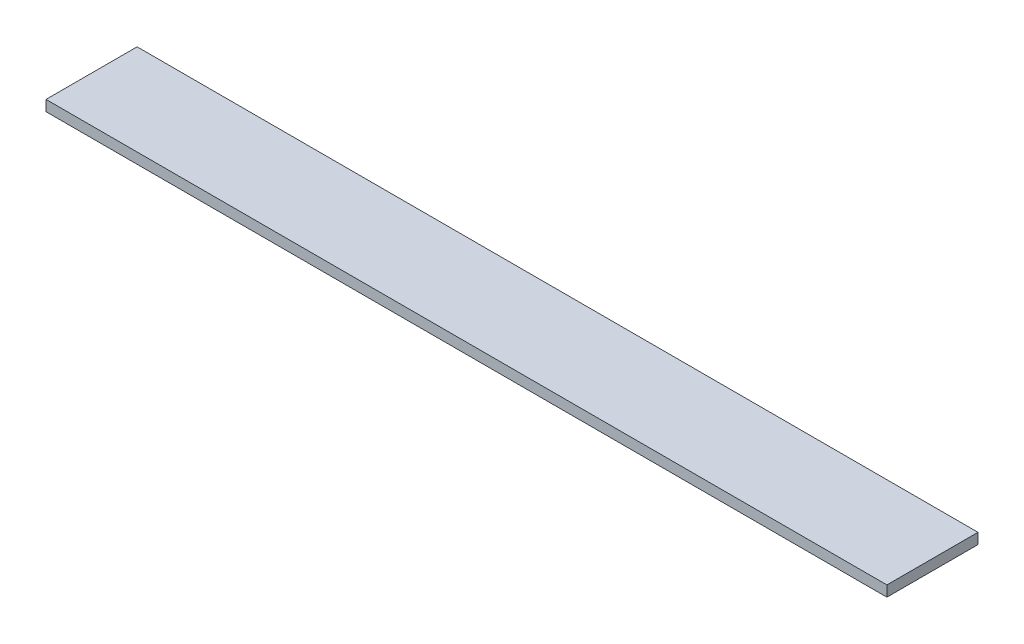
from build123d import *

# Parameters (mm, degrees)
SKETCH1_W      = 762
SKETCH1_H      = 82.55
EXTRUDE1_DEPTH = 9.652


with BuildPart() as part:
    # Sketch1 → Extrude1 (new body)
    with BuildSketch(Plane(origin=(0, 0, 0), x_dir=(1, 0, 0), z_dir=(0, 1, 0))):
        with Locations((381, 41.275)):
            Rectangle(SKETCH1_W, SKETCH1_H)
    extrude(amount=EXTRUDE1_DEPTH)


solid = part.part
